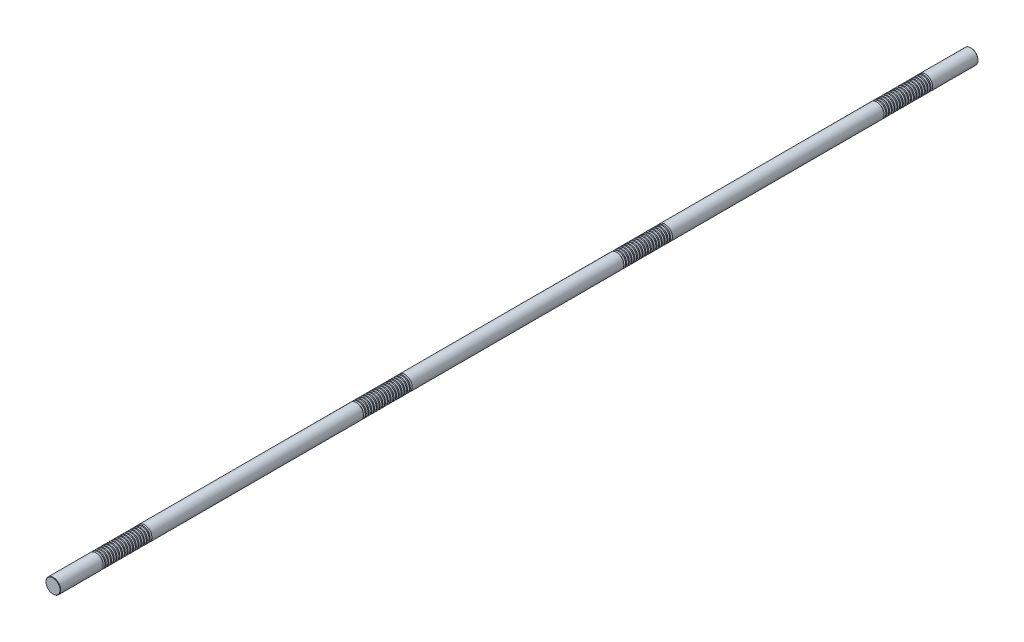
from build123d import *

# Parameters (mm, degrees)
SKETCH1_R           = 16
BOSS_EXTRUDE1_DEPTH = 1000
CHAMFER1_SIZE       = 0.8
LPATTERN1_COUNT     = 18
LPATTERN1_PITCH     = 6
LPATTERN2_COUNT     = 4
LPATTERN2_PITCH     = 567


with BuildPart() as part:
    # Sketch1 → Boss-Extrude1 (new, symmetric)
    with BuildSketch(Plane.XY):
        Circle(SKETCH1_R)
    extrude(amount=BOSS_EXTRUDE1_DEPTH, both=True)

    # Chamfer1
    chamfer1_edges = [part.edges().sort_by_distance(p)[0] for p in [
        (-16, 0, -1000),
        (-16, 0, 1000),
    ]]
    chamfer(chamfer1_edges, length=CHAMFER1_SIZE)

    # Sketch2 → Cut-Revolve1 (revolve, cut)
    with BuildSketch(Plane(origin=(0, 0, 0), x_dir=(0, 0, -1), z_dir=(1, 0, 0)), mode=Mode.PRIVATE) as cut_revolve1_sk:
        Polygon((900.468911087, 16), (896.531088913, 16), (897.468911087, 12.5), (899.531088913, 12.5), align=None)
    cut_revolve1 = revolve(cut_revolve1_sk.sketch.rotate(Axis((0, 0, 1000), (0, 0, -1)), 90), axis=Axis((0, 0, 1000), (0, 0, -1)), mode=Mode.SUBTRACT)

    # LPattern1: Cut-Revolve1 ×18
    with Locations(*[(0, 0, i * LPATTERN1_PITCH) for i in range(1, LPATTERN1_COUNT)]):
        add(cut_revolve1, mode=Mode.SUBTRACT)

    # LPattern2: Cut-Revolve1 ×4
    with Locations(*[(0, 0, i * LPATTERN2_PITCH) for i in range(1, LPATTERN2_COUNT)]):
        add(cut_revolve1, mode=Mode.SUBTRACT)

    # LPattern2 copy 1 sketch → LPattern2 copy 1 (revolve, cut)
    with BuildSketch(Plane(origin=(0, 0, 573), x_dir=(0, 0, -1), z_dir=(1, 0, 0))):
        Polygon((900.468911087, 16), (896.531088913, 16), (897.468911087, 12.5), (899.531088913, 12.5), align=None)
    revolve(axis=Axis((0, 0, 1573), (0, 0, -1)), mode=Mode.SUBTRACT)

    # LPattern2 copy 2 sketch → LPattern2 copy 2 (revolve, cut)
    with BuildSketch(Plane(origin=(0, 0, 1140), x_dir=(0, 0, -1), z_dir=(1, 0, 0))):
        Polygon((900.468911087, 16), (896.531088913, 16), (897.468911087, 12.5), (899.531088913, 12.5), align=None)
    revolve(axis=Axis((0, 0, 2140), (0, 0, -1)), mode=Mode.SUBTRACT)

    # LPattern2 copy 3 sketch → LPattern2 copy 3 (revolve, cut)
    with BuildSketch(Plane(origin=(0, 0, 1707), x_dir=(0, 0, -1), z_dir=(1, 0, 0))):
        Polygon((900.468911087, 16), (896.531088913, 16), (897.468911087, 12.5), (899.531088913, 12.5), align=None)
    revolve(axis=Axis((0, 0, 2707), (0, 0, -1)), mode=Mode.SUBTRACT)

    # LPattern2 copy 4 sketch → LPattern2 copy 4 (revolve, cut)
    with BuildSketch(Plane(origin=(0, 0, 579), x_dir=(0, 0, -1), z_dir=(1, 0, 0))):
        Polygon((900.468911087, 16), (896.531088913, 16), (897.468911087, 12.5), (899.531088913, 12.5), align=None)
    revolve(axis=Axis((0, 0, 1579), (0, 0, -1)), mode=Mode.SUBTRACT)

    # LPattern2 copy 5 sketch → LPattern2 copy 5 (revolve, cut)
    with BuildSketch(Plane(origin=(0, 0, 1146), x_dir=(0, 0, -1), z_dir=(1, 0, 0))):
        Polygon((900.468911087, 16), (896.531088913, 16), (897.468911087, 12.5), (899.531088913, 12.5), align=None)
    revolve(axis=Axis((0, 0, 2146), (0, 0, -1)), mode=Mode.SUBTRACT)

    # LPattern2 copy 6 sketch → LPattern2 copy 6 (revolve, cut)
    with BuildSketch(Plane(origin=(0, 0, 1713), x_dir=(0, 0, -1), z_dir=(1, 0, 0))):
        Polygon((900.468911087, 16), (896.531088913, 16), (897.468911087, 12.5), (899.531088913, 12.5), align=None)
    revolve(axis=Axis((0, 0, 2713), (0, 0, -1)), mode=Mode.SUBTRACT)

    # LPattern2 copy 7 sketch → LPattern2 copy 7 (revolve, cut)
    with BuildSketch(Plane(origin=(0, 0, 585), x_dir=(0, 0, -1), z_dir=(1, 0, 0))):
        Polygon((900.468911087, 16), (896.531088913, 16), (897.468911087, 12.5), (899.531088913, 12.5), align=None)
    revolve(axis=Axis((0, 0, 1585), (0, 0, -1)), mode=Mode.SUBTRACT)

    # LPattern2 copy 8 sketch → LPattern2 copy 8 (revolve, cut)
    with BuildSketch(Plane(origin=(0, 0, 1152), x_dir=(0, 0, -1), z_dir=(1, 0, 0))):
        Polygon((900.468911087, 16), (896.531088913, 16), (897.468911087, 12.5), (899.531088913, 12.5), align=None)
    revolve(axis=Axis((0, 0, 2152), (0, 0, -1)), mode=Mode.SUBTRACT)

    # LPattern2 copy 9 sketch → LPattern2 copy 9 (revolve, cut)
    with BuildSketch(Plane(origin=(0, 0, 1719), x_dir=(0, 0, -1), z_dir=(1, 0, 0))):
        Polygon((900.468911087, 16), (896.531088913, 16), (897.468911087, 12.5), (899.531088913, 12.5), align=None)
    revolve(axis=Axis((0, 0, 2719), (0, 0, -1)), mode=Mode.SUBTRACT)

    # LPattern2 copy 10 sketch → LPattern2 copy 10 (revolve, cut)
    with BuildSketch(Plane(origin=(0, 0, 591), x_dir=(0, 0, -1), z_dir=(1, 0, 0))):
        Polygon((900.468911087, 16), (896.531088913, 16), (897.468911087, 12.5), (899.531088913, 12.5), align=None)
    revolve(axis=Axis((0, 0, 1591), (0, 0, -1)), mode=Mode.SUBTRACT)

    # LPattern2 copy 11 sketch → LPattern2 copy 11 (revolve, cut)
    with BuildSketch(Plane(origin=(0, 0, 1158), x_dir=(0, 0, -1), z_dir=(1, 0, 0))):
        Polygon((900.468911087, 16), (896.531088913, 16), (897.468911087, 12.5), (899.531088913, 12.5), align=None)
    revolve(axis=Axis((0, 0, 2158), (0, 0, -1)), mode=Mode.SUBTRACT)

    # LPattern2 copy 12 sketch → LPattern2 copy 12 (revolve, cut)
    with BuildSketch(Plane(origin=(0, 0, 1725), x_dir=(0, 0, -1), z_dir=(1, 0, 0))):
        Polygon((900.468911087, 16), (896.531088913, 16), (897.468911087, 12.5), (899.531088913, 12.5), align=None)
    revolve(axis=Axis((0, 0, 2725), (0, 0, -1)), mode=Mode.SUBTRACT)

    # LPattern2 copy 13 sketch → LPattern2 copy 13 (revolve, cut)
    with BuildSketch(Plane(origin=(0, 0, 597), x_dir=(0, 0, -1), z_dir=(1, 0, 0))):
        Polygon((900.468911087, 16), (896.531088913, 16), (897.468911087, 12.5), (899.531088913, 12.5), align=None)
    revolve(axis=Axis((0, 0, 1597), (0, 0, -1)), mode=Mode.SUBTRACT)

    # LPattern2 copy 14 sketch → LPattern2 copy 14 (revolve, cut)
    with BuildSketch(Plane(origin=(0, 0, 1164), x_dir=(0, 0, -1), z_dir=(1, 0, 0))):
        Polygon((900.468911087, 16), (896.531088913, 16), (897.468911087, 12.5), (899.531088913, 12.5), align=None)
    revolve(axis=Axis((0, 0, 2164), (0, 0, -1)), mode=Mode.SUBTRACT)

    # LPattern2 copy 15 sketch → LPattern2 copy 15 (revolve, cut)
    with BuildSketch(Plane(origin=(0, 0, 1731), x_dir=(0, 0, -1), z_dir=(1, 0, 0))):
        Polygon((900.468911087, 16), (896.531088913, 16), (897.468911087, 12.5), (899.531088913, 12.5), align=None)
    revolve(axis=Axis((0, 0, 2731), (0, 0, -1)), mode=Mode.SUBTRACT)

    # LPattern2 copy 16 sketch → LPattern2 copy 16 (revolve, cut)
    with BuildSketch(Plane(origin=(0, 0, 603), x_dir=(0, 0, -1), z_dir=(1, 0, 0))):
        Polygon((900.468911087, 16), (896.531088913, 16), (897.468911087, 12.5), (899.531088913, 12.5), align=None)
    revolve(axis=Axis((0, 0, 1603), (0, 0, -1)), mode=Mode.SUBTRACT)

    # LPattern2 copy 17 sketch → LPattern2 copy 17 (revolve, cut)
    with BuildSketch(Plane(origin=(0, 0, 1170), x_dir=(0, 0, -1), z_dir=(1, 0, 0))):
        Polygon((900.468911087, 16), (896.531088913, 16), (897.468911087, 12.5), (899.531088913, 12.5), align=None)
    revolve(axis=Axis((0, 0, 2170), (0, 0, -1)), mode=Mode.SUBTRACT)

    # LPattern2 copy 18 sketch → LPattern2 copy 18 (revolve, cut)
    with BuildSketch(Plane(origin=(0, 0, 1737), x_dir=(0, 0, -1), z_dir=(1, 0, 0))):
        Polygon((900.468911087, 16), (896.531088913, 16), (897.468911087, 12.5), (899.531088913, 12.5), align=None)
    revolve(axis=Axis((0, 0, 2737), (0, 0, -1)), mode=Mode.SUBTRACT)

    # LPattern2 copy 19 sketch → LPattern2 copy 19 (revolve, cut)
    with BuildSketch(Plane(origin=(0, 0, 609), x_dir=(0, 0, -1), z_dir=(1, 0, 0))):
        Polygon((900.468911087, 16), (896.531088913, 16), (897.468911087, 12.5), (899.531088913, 12.5), align=None)
    revolve(axis=Axis((0, 0, 1609), (0, 0, -1)), mode=Mode.SUBTRACT)

    # LPattern2 copy 20 sketch → LPattern2 copy 20 (revolve, cut)
    with BuildSketch(Plane(origin=(0, 0, 1176), x_dir=(0, 0, -1), z_dir=(1, 0, 0))):
        Polygon((900.468911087, 16), (896.531088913, 16), (897.468911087, 12.5), (899.531088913, 12.5), align=None)
    revolve(axis=Axis((0, 0, 2176), (0, 0, -1)), mode=Mode.SUBTRACT)

    # LPattern2 copy 21 sketch → LPattern2 copy 21 (revolve, cut)
    with BuildSketch(Plane(origin=(0, 0, 1743), x_dir=(0, 0, -1), z_dir=(1, 0, 0))):
        Polygon((900.468911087, 16), (896.531088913, 16), (897.468911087, 12.5), (899.531088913, 12.5), align=None)
    revolve(axis=Axis((0, 0, 2743), (0, 0, -1)), mode=Mode.SUBTRACT)

    # LPattern2 copy 22 sketch → LPattern2 copy 22 (revolve, cut)
    with BuildSketch(Plane(origin=(0, 0, 615), x_dir=(0, 0, -1), z_dir=(1, 0, 0))):
        Polygon((900.468911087, 16), (896.531088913, 16), (897.468911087, 12.5), (899.531088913, 12.5), align=None)
    revolve(axis=Axis((0, 0, 1615), (0, 0, -1)), mode=Mode.SUBTRACT)

    # LPattern2 copy 23 sketch → LPattern2 copy 23 (revolve, cut)
    with BuildSketch(Plane(origin=(0, 0, 1182), x_dir=(0, 0, -1), z_dir=(1, 0, 0))):
        Polygon((900.468911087, 16), (896.531088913, 16), (897.468911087, 12.5), (899.531088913, 12.5), align=None)
    revolve(axis=Axis((0, 0, 2182), (0, 0, -1)), mode=Mode.SUBTRACT)

    # LPattern2 copy 24 sketch → LPattern2 copy 24 (revolve, cut)
    with BuildSketch(Plane(origin=(0, 0, 1749), x_dir=(0, 0, -1), z_dir=(1, 0, 0))):
        Polygon((900.468911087, 16), (896.531088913, 16), (897.468911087, 12.5), (899.531088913, 12.5), align=None)
    revolve(axis=Axis((0, 0, 2749), (0, 0, -1)), mode=Mode.SUBTRACT)

    # LPattern2 copy 25 sketch → LPattern2 copy 25 (revolve, cut)
    with BuildSketch(Plane(origin=(0, 0, 621), x_dir=(0, 0, -1), z_dir=(1, 0, 0))):
        Polygon((900.468911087, 16), (896.531088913, 16), (897.468911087, 12.5), (899.531088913, 12.5), align=None)
    revolve(axis=Axis((0, 0, 1621), (0, 0, -1)), mode=Mode.SUBTRACT)

    # LPattern2 copy 26 sketch → LPattern2 copy 26 (revolve, cut)
    with BuildSketch(Plane(origin=(0, 0, 1188), x_dir=(0, 0, -1), z_dir=(1, 0, 0))):
        Polygon((900.468911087, 16), (896.531088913, 16), (897.468911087, 12.5), (899.531088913, 12.5), align=None)
    revolve(axis=Axis((0, 0, 2188), (0, 0, -1)), mode=Mode.SUBTRACT)

    # LPattern2 copy 27 sketch → LPattern2 copy 27 (revolve, cut)
    with BuildSketch(Plane(origin=(0, 0, 1755), x_dir=(0, 0, -1), z_dir=(1, 0, 0))):
        Polygon((900.468911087, 16), (896.531088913, 16), (897.468911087, 12.5), (899.531088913, 12.5), align=None)
    revolve(axis=Axis((0, 0, 2755), (0, 0, -1)), mode=Mode.SUBTRACT)

    # LPattern2 copy 28 sketch → LPattern2 copy 28 (revolve, cut)
    with BuildSketch(Plane(origin=(0, 0, 627), x_dir=(0, 0, -1), z_dir=(1, 0, 0))):
        Polygon((900.468911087, 16), (896.531088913, 16), (897.468911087, 12.5), (899.531088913, 12.5), align=None)
    revolve(axis=Axis((0, 0, 1627), (0, 0, -1)), mode=Mode.SUBTRACT)

    # LPattern2 copy 29 sketch → LPattern2 copy 29 (revolve, cut)
    with BuildSketch(Plane(origin=(0, 0, 1194), x_dir=(0, 0, -1), z_dir=(1, 0, 0))):
        Polygon((900.468911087, 16), (896.531088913, 16), (897.468911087, 12.5), (899.531088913, 12.5), align=None)
    revolve(axis=Axis((0, 0, 2194), (0, 0, -1)), mode=Mode.SUBTRACT)

    # LPattern2 copy 30 sketch → LPattern2 copy 30 (revolve, cut)
    with BuildSketch(Plane(origin=(0, 0, 1761), x_dir=(0, 0, -1), z_dir=(1, 0, 0))):
        Polygon((900.468911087, 16), (896.531088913, 16), (897.468911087, 12.5), (899.531088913, 12.5), align=None)
    revolve(axis=Axis((0, 0, 2761), (0, 0, -1)), mode=Mode.SUBTRACT)

    # LPattern2 copy 31 sketch → LPattern2 copy 31 (revolve, cut)
    with BuildSketch(Plane(origin=(0, 0, 633), x_dir=(0, 0, -1), z_dir=(1, 0, 0))):
        Polygon((900.468911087, 16), (896.531088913, 16), (897.468911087, 12.5), (899.531088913, 12.5), align=None)
    revolve(axis=Axis((0, 0, 1633), (0, 0, -1)), mode=Mode.SUBTRACT)

    # LPattern2 copy 32 sketch → LPattern2 copy 32 (revolve, cut)
    with BuildSketch(Plane(origin=(0, 0, 1200), x_dir=(0, 0, -1), z_dir=(1, 0, 0))):
        Polygon((900.468911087, 16), (896.531088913, 16), (897.468911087, 12.5), (899.531088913, 12.5), align=None)
    revolve(axis=Axis((0, 0, 2200), (0, 0, -1)), mode=Mode.SUBTRACT)

    # LPattern2 copy 33 sketch → LPattern2 copy 33 (revolve, cut)
    with BuildSketch(Plane(origin=(0, 0, 1767), x_dir=(0, 0, -1), z_dir=(1, 0, 0))):
        Polygon((900.468911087, 16), (896.531088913, 16), (897.468911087, 12.5), (899.531088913, 12.5), align=None)
    revolve(axis=Axis((0, 0, 2767), (0, 0, -1)), mode=Mode.SUBTRACT)

    # LPattern2 copy 34 sketch → LPattern2 copy 34 (revolve, cut)
    with BuildSketch(Plane(origin=(0, 0, 639), x_dir=(0, 0, -1), z_dir=(1, 0, 0))):
        Polygon((900.468911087, 16), (896.531088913, 16), (897.468911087, 12.5), (899.531088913, 12.5), align=None)
    revolve(axis=Axis((0, 0, 1639), (0, 0, -1)), mode=Mode.SUBTRACT)

    # LPattern2 copy 35 sketch → LPattern2 copy 35 (revolve, cut)
    with BuildSketch(Plane(origin=(0, 0, 1206), x_dir=(0, 0, -1), z_dir=(1, 0, 0))):
        Polygon((900.468911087, 16), (896.531088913, 16), (897.468911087, 12.5), (899.531088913, 12.5), align=None)
    revolve(axis=Axis((0, 0, 2206), (0, 0, -1)), mode=Mode.SUBTRACT)

    # LPattern2 copy 36 sketch → LPattern2 copy 36 (revolve, cut)
    with BuildSketch(Plane(origin=(0, 0, 1773), x_dir=(0, 0, -1), z_dir=(1, 0, 0))):
        Polygon((900.468911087, 16), (896.531088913, 16), (897.468911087, 12.5), (899.531088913, 12.5), align=None)
    revolve(axis=Axis((0, 0, 2773), (0, 0, -1)), mode=Mode.SUBTRACT)

    # LPattern2 copy 37 sketch → LPattern2 copy 37 (revolve, cut)
    with BuildSketch(Plane(origin=(0, 0, 645), x_dir=(0, 0, -1), z_dir=(1, 0, 0))):
        Polygon((900.468911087, 16), (896.531088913, 16), (897.468911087, 12.5), (899.531088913, 12.5), align=None)
    revolve(axis=Axis((0, 0, 1645), (0, 0, -1)), mode=Mode.SUBTRACT)

    # LPattern2 copy 38 sketch → LPattern2 copy 38 (revolve, cut)
    with BuildSketch(Plane(origin=(0, 0, 1212), x_dir=(0, 0, -1), z_dir=(1, 0, 0))):
        Polygon((900.468911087, 16), (896.531088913, 16), (897.468911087, 12.5), (899.531088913, 12.5), align=None)
    revolve(axis=Axis((0, 0, 2212), (0, 0, -1)), mode=Mode.SUBTRACT)

    # LPattern2 copy 39 sketch → LPattern2 copy 39 (revolve, cut)
    with BuildSketch(Plane(origin=(0, 0, 1779), x_dir=(0, 0, -1), z_dir=(1, 0, 0))):
        Polygon((900.468911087, 16), (896.531088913, 16), (897.468911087, 12.5), (899.531088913, 12.5), align=None)
    revolve(axis=Axis((0, 0, 2779), (0, 0, -1)), mode=Mode.SUBTRACT)

    # LPattern2 copy 40 sketch → LPattern2 copy 40 (revolve, cut)
    with BuildSketch(Plane(origin=(0, 0, 651), x_dir=(0, 0, -1), z_dir=(1, 0, 0))):
        Polygon((900.468911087, 16), (896.531088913, 16), (897.468911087, 12.5), (899.531088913, 12.5), align=None)
    revolve(axis=Axis((0, 0, 1651), (0, 0, -1)), mode=Mode.SUBTRACT)

    # LPattern2 copy 41 sketch → LPattern2 copy 41 (revolve, cut)
    with BuildSketch(Plane(origin=(0, 0, 1218), x_dir=(0, 0, -1), z_dir=(1, 0, 0))):
        Polygon((900.468911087, 16), (896.531088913, 16), (897.468911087, 12.5), (899.531088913, 12.5), align=None)
    revolve(axis=Axis((0, 0, 2218), (0, 0, -1)), mode=Mode.SUBTRACT)

    # LPattern2 copy 42 sketch → LPattern2 copy 42 (revolve, cut)
    with BuildSketch(Plane(origin=(0, 0, 1785), x_dir=(0, 0, -1), z_dir=(1, 0, 0))):
        Polygon((900.468911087, 16), (896.531088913, 16), (897.468911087, 12.5), (899.531088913, 12.5), align=None)
    revolve(axis=Axis((0, 0, 2785), (0, 0, -1)), mode=Mode.SUBTRACT)

    # LPattern2 copy 43 sketch → LPattern2 copy 43 (revolve, cut)
    with BuildSketch(Plane(origin=(0, 0, 657), x_dir=(0, 0, -1), z_dir=(1, 0, 0))):
        Polygon((900.468911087, 16), (896.531088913, 16), (897.468911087, 12.5), (899.531088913, 12.5), align=None)
    revolve(axis=Axis((0, 0, 1657), (0, 0, -1)), mode=Mode.SUBTRACT)

    # LPattern2 copy 44 sketch → LPattern2 copy 44 (revolve, cut)
    with BuildSketch(Plane(origin=(0, 0, 1224), x_dir=(0, 0, -1), z_dir=(1, 0, 0))):
        Polygon((900.468911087, 16), (896.531088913, 16), (897.468911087, 12.5), (899.531088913, 12.5), align=None)
    revolve(axis=Axis((0, 0, 2224), (0, 0, -1)), mode=Mode.SUBTRACT)

    # LPattern2 copy 45 sketch → LPattern2 copy 45 (revolve, cut)
    with BuildSketch(Plane(origin=(0, 0, 1791), x_dir=(0, 0, -1), z_dir=(1, 0, 0))):
        Polygon((900.468911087, 16), (896.531088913, 16), (897.468911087, 12.5), (899.531088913, 12.5), align=None)
    revolve(axis=Axis((0, 0, 2791), (0, 0, -1)), mode=Mode.SUBTRACT)

    # LPattern2 copy 46 sketch → LPattern2 copy 46 (revolve, cut)
    with BuildSketch(Plane(origin=(0, 0, 663), x_dir=(0, 0, -1), z_dir=(1, 0, 0))):
        Polygon((900.468911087, 16), (896.531088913, 16), (897.468911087, 12.5), (899.531088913, 12.5), align=None)
    revolve(axis=Axis((0, 0, 1663), (0, 0, -1)), mode=Mode.SUBTRACT)

    # LPattern2 copy 47 sketch → LPattern2 copy 47 (revolve, cut)
    with BuildSketch(Plane(origin=(0, 0, 1230), x_dir=(0, 0, -1), z_dir=(1, 0, 0))):
        Polygon((900.468911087, 16), (896.531088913, 16), (897.468911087, 12.5), (899.531088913, 12.5), align=None)
    revolve(axis=Axis((0, 0, 2230), (0, 0, -1)), mode=Mode.SUBTRACT)

    # LPattern2 copy 48 sketch → LPattern2 copy 48 (revolve, cut)
    with BuildSketch(Plane(origin=(0, 0, 1797), x_dir=(0, 0, -1), z_dir=(1, 0, 0))):
        Polygon((900.468911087, 16), (896.531088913, 16), (897.468911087, 12.5), (899.531088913, 12.5), align=None)
    revolve(axis=Axis((0, 0, 2797), (0, 0, -1)), mode=Mode.SUBTRACT)

    # LPattern2 copy 49 sketch → LPattern2 copy 49 (revolve, cut)
    with BuildSketch(Plane(origin=(0, 0, 669), x_dir=(0, 0, -1), z_dir=(1, 0, 0))):
        Polygon((900.468911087, 16), (896.531088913, 16), (897.468911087, 12.5), (899.531088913, 12.5), align=None)
    revolve(axis=Axis((0, 0, 1669), (0, 0, -1)), mode=Mode.SUBTRACT)

    # LPattern2 copy 50 sketch → LPattern2 copy 50 (revolve, cut)
    with BuildSketch(Plane(origin=(0, 0, 1236), x_dir=(0, 0, -1), z_dir=(1, 0, 0))):
        Polygon((900.468911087, 16), (896.531088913, 16), (897.468911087, 12.5), (899.531088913, 12.5), align=None)
    revolve(axis=Axis((0, 0, 2236), (0, 0, -1)), mode=Mode.SUBTRACT)

    # LPattern2 copy 51 sketch → LPattern2 copy 51 (revolve, cut)
    with BuildSketch(Plane(origin=(0, 0, 1803), x_dir=(0, 0, -1), z_dir=(1, 0, 0))):
        Polygon((900.468911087, 16), (896.531088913, 16), (897.468911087, 12.5), (899.531088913, 12.5), align=None)
    revolve(axis=Axis((0, 0, 2803), (0, 0, -1)), mode=Mode.SUBTRACT)


solid = part.part
